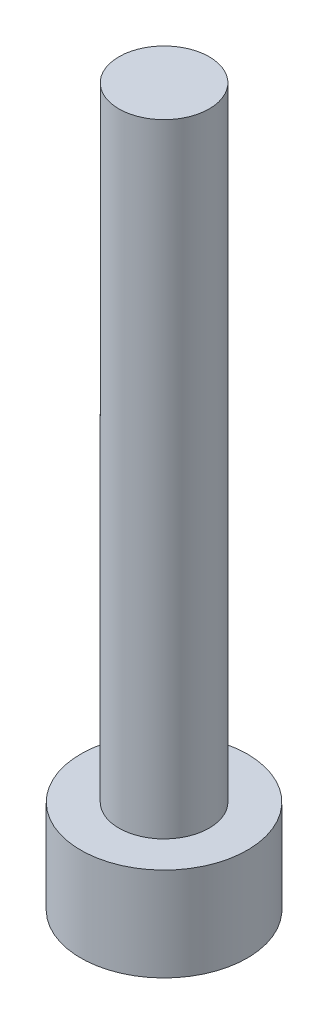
ISO-10303-21;
HEADER;
FILE_DESCRIPTION(('STEP AP214'),'2;1');
FILE_NAME('part.step','',(''),(''),'','','');
FILE_SCHEMA(('AUTOMOTIVE_DESIGN { 1 0 10303 214 1 1 1 1 }'));
ENDSEC;
DATA;
#1=APPLICATION_CONTEXT('core data for automotive mechanical design processes');
#2=APPLICATION_PROTOCOL_DEFINITION('international standard','automotive_design',2000,#1);
#3=PRODUCT_CONTEXT('',#1,'mechanical');
#4=PRODUCT('Part','Part','',(#3));
#5=PRODUCT_RELATED_PRODUCT_CATEGORY('part','',(#4));
#6=PRODUCT_DEFINITION_FORMATION('','',#4);
#7=PRODUCT_DEFINITION_CONTEXT('part definition',#1,'design');
#8=PRODUCT_DEFINITION('design','',#6,#7);
#9=PRODUCT_DEFINITION_SHAPE('','',#8);
#10=(LENGTH_UNIT() NAMED_UNIT(*) SI_UNIT(.MILLI.,.METRE.));
#11=(NAMED_UNIT(*) PLANE_ANGLE_UNIT() SI_UNIT($,.RADIAN.));
#12=(NAMED_UNIT(*) SI_UNIT($,.STERADIAN.) SOLID_ANGLE_UNIT());
#13=UNCERTAINTY_MEASURE_WITH_UNIT(LENGTH_MEASURE(1.E-05),#10,'distance_accuracy_value','');
#14=(GEOMETRIC_REPRESENTATION_CONTEXT(3) GLOBAL_UNCERTAINTY_ASSIGNED_CONTEXT((#13)) GLOBAL_UNIT_ASSIGNED_CONTEXT((#10,
#11,#12)) REPRESENTATION_CONTEXT('',''));
#15=CARTESIAN_POINT('',(0.,0.,0.));
#16=DIRECTION('',(0.,0.,1.));
#17=DIRECTION('',(1.,0.,0.));
#18=AXIS2_PLACEMENT_3D('',#15,#16,#17);
#19=CARTESIAN_POINT('',(0.,20.,0.));
#20=DIRECTION('',(0.,-1.,0.));
#21=DIRECTION('',(0.,0.,-1.));
#22=AXIS2_PLACEMENT_3D('',#19,#20,#21);
#23=CYLINDRICAL_SURFACE('',#22,1.45);
#24=CARTESIAN_POINT('',(0.,20.,0.));
#25=DIRECTION('',(0.,1.,0.));
#26=DIRECTION('',(0.,0.,1.));
#27=AXIS2_PLACEMENT_3D('',#24,#25,#26);
#28=CIRCLE('',#27,1.45);
#29=CARTESIAN_POINT('',(0.,20.,1.45));
#30=VERTEX_POINT('',#29);
#31=EDGE_CURVE('E11',#30,#30,#28,.T.);
#32=ORIENTED_EDGE('',*,*,#31,.F.);
#33=EDGE_LOOP('',(#32));
#34=FACE_BOUND('',#33,.T.);
#35=CARTESIAN_POINT('',(0.,0.,0.));
#36=DIRECTION('',(0.,-1.,0.));
#37=DIRECTION('',(0.,0.,-1.));
#38=AXIS2_PLACEMENT_3D('',#35,#36,#37);
#39=CIRCLE('',#38,1.45);
#40=CARTESIAN_POINT('',(0.,0.,-1.45));
#41=VERTEX_POINT('',#40);
#42=EDGE_CURVE('E39',#41,#41,#39,.T.);
#43=ORIENTED_EDGE('',*,*,#42,.F.);
#44=EDGE_LOOP('',(#43));
#45=FACE_BOUND('',#44,.T.);
#46=ADVANCED_FACE('F32',(#34,#45),#23,.T.);
#47=CARTESIAN_POINT('',(0.,20.,0.));
#48=DIRECTION('',(0.,1.,0.));
#49=DIRECTION('',(0.,0.,1.));
#50=AXIS2_PLACEMENT_3D('',#47,#48,#49);
#51=PLANE('',#50);
#52=ORIENTED_EDGE('',*,*,#31,.T.);
#53=EDGE_LOOP('',(#52));
#54=FACE_BOUND('',#53,.T.);
#55=ADVANCED_FACE('F149',(#54),#51,.T.);
#56=CARTESIAN_POINT('',(0.,0.,0.));
#57=DIRECTION('',(0.,-1.,0.));
#58=DIRECTION('',(0.,0.,-1.));
#59=AXIS2_PLACEMENT_3D('',#56,#57,#58);
#60=PLANE('',#59);
#61=CARTESIAN_POINT('',(0.,0.,0.));
#62=DIRECTION('',(0.,-1.,0.));
#63=DIRECTION('',(0.,0.,-1.));
#64=AXIS2_PLACEMENT_3D('',#61,#62,#63);
#65=CIRCLE('',#64,2.675);
#66=CARTESIAN_POINT('',(0.,0.,-2.675));
#67=VERTEX_POINT('',#66);
#68=EDGE_CURVE('E133',#67,#67,#65,.T.);
#69=ORIENTED_EDGE('',*,*,#68,.F.);
#70=EDGE_LOOP('',(#69));
#71=FACE_BOUND('',#70,.T.);
#72=ORIENTED_EDGE('',*,*,#42,.T.);
#73=EDGE_LOOP('',(#72));
#74=FACE_BOUND('',#73,.T.);
#75=ADVANCED_FACE('F146',(#71,#74),#60,.F.);
#76=CARTESIAN_POINT('',(0.,-3.,0.));
#77=DIRECTION('',(0.,1.,0.));
#78=DIRECTION('',(0.,0.,1.));
#79=AXIS2_PLACEMENT_3D('',#76,#77,#78);
#80=CYLINDRICAL_SURFACE('',#79,2.675);
#81=CARTESIAN_POINT('',(0.,-3.,0.));
#82=DIRECTION('',(0.,-1.,0.));
#83=DIRECTION('',(0.,0.,-1.));
#84=AXIS2_PLACEMENT_3D('',#81,#82,#83);
#85=CIRCLE('',#84,2.675);
#86=CARTESIAN_POINT('',(0.,-3.,-2.675));
#87=VERTEX_POINT('',#86);
#88=EDGE_CURVE('E139',#87,#87,#85,.T.);
#89=ORIENTED_EDGE('',*,*,#88,.F.);
#90=EDGE_LOOP('',(#89));
#91=FACE_BOUND('',#90,.T.);
#92=ORIENTED_EDGE('',*,*,#68,.T.);
#93=EDGE_LOOP('',(#92));
#94=FACE_BOUND('',#93,.T.);
#95=ADVANCED_FACE('F159',(#91,#94),#80,.T.);
#96=CARTESIAN_POINT('',(0.,-3.,0.));
#97=DIRECTION('',(0.,-1.,0.));
#98=DIRECTION('',(0.,0.,-1.));
#99=AXIS2_PLACEMENT_3D('',#96,#97,#98);
#100=PLANE('',#99);
#101=DIRECTION('',(0.23586840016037,0.,0.971785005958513));
#102=VECTOR('',#101,1.);
#103=CARTESIAN_POINT('',(1.25340948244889,-3.,-1.19539310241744));
#104=LINE('',#103,#102);
#105=CARTESIAN_POINT('',(1.25340948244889,-3.,-1.19539310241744));
#106=VERTEX_POINT('',#105);
#107=CARTESIAN_POINT('',(1.66194553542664,-3.,0.487787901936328));
#108=VERTEX_POINT('',#107);
#109=EDGE_CURVE('E46',#106,#108,#104,.T.);
#110=ORIENTED_EDGE('',*,*,#109,.F.);
#111=DIRECTION('',(0.95952470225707,0.,0.281624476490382));
#112=VECTOR('',#111,1.);
#113=CARTESIAN_POINT('',(-0.408536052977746,-3.,-1.68318100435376));
#114=LINE('',#113,#112);
#115=CARTESIAN_POINT('',(-0.408536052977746,-3.,-1.68318100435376));
#116=VERTEX_POINT('',#115);
#117=EDGE_CURVE('E129',#116,#106,#114,.T.);
#118=ORIENTED_EDGE('',*,*,#117,.F.);
#119=DIRECTION('',(0.723656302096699,0.,-0.690160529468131));
#120=VECTOR('',#119,1.);
#121=CARTESIAN_POINT('',(-1.66194553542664,-3.,-0.487787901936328));
#122=LINE('',#121,#120);
#123=CARTESIAN_POINT('',(-1.66194553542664,-3.,-0.487787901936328));
#124=VERTEX_POINT('',#123);
#125=EDGE_CURVE('E127',#124,#116,#122,.T.);
#126=ORIENTED_EDGE('',*,*,#125,.F.);
#127=DIRECTION('',(-0.23586840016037,0.,-0.971785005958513));
#128=VECTOR('',#127,1.);
#129=CARTESIAN_POINT('',(-1.25340948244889,-3.,1.19539310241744));
#130=LINE('',#129,#128);
#131=CARTESIAN_POINT('',(-1.25340948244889,-3.,1.19539310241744));
#132=VERTEX_POINT('',#131);
#133=EDGE_CURVE('E94',#132,#124,#130,.T.);
#134=ORIENTED_EDGE('',*,*,#133,.F.);
#135=DIRECTION('',(-0.95952470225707,0.,-0.281624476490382));
#136=VECTOR('',#135,1.);
#137=CARTESIAN_POINT('',(0.408536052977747,-3.,1.68318100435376));
#138=LINE('',#137,#136);
#139=CARTESIAN_POINT('',(0.408536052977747,-3.,1.68318100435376));
#140=VERTEX_POINT('',#139);
#141=EDGE_CURVE('E123',#140,#132,#138,.T.);
#142=ORIENTED_EDGE('',*,*,#141,.F.);
#143=DIRECTION('',(-0.723656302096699,0.,0.690160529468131));
#144=VECTOR('',#143,1.);
#145=CARTESIAN_POINT('',(1.66194553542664,-3.,0.487787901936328));
#146=LINE('',#145,#144);
#147=EDGE_CURVE('E120',#108,#140,#146,.T.);
#148=ORIENTED_EDGE('',*,*,#147,.F.);
#149=EDGE_LOOP('',(#110,#118,#126,#134,#142,#148));
#150=FACE_BOUND('',#149,.T.);
#151=ORIENTED_EDGE('',*,*,#88,.T.);
#152=EDGE_LOOP('',(#151));
#153=FACE_BOUND('',#152,.T.);
#154=ADVANCED_FACE('F164',(#150,#153),#100,.T.);
#155=CARTESIAN_POINT('',(1.25340948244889,-1.,-1.19539310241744));
#156=DIRECTION('',(0.971785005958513,0.,-0.23586840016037));
#157=DIRECTION('',(-0.23586840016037,0.,-0.971785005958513));
#158=AXIS2_PLACEMENT_3D('',#155,#156,#157);
#159=PLANE('',#158);
#160=ORIENTED_EDGE('',*,*,#109,.T.);
#161=DIRECTION('',(0.,-1.,0.));
#162=VECTOR('',#161,1.);
#163=CARTESIAN_POINT('',(1.66194553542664,-1.,0.487787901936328));
#164=LINE('',#163,#162);
#165=CARTESIAN_POINT('',(1.66194553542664,-1.,0.487787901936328));
#166=VERTEX_POINT('',#165);
#167=EDGE_CURVE('E76',#166,#108,#164,.T.);
#168=ORIENTED_EDGE('',*,*,#167,.F.);
#169=DIRECTION('',(0.23586840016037,0.,0.971785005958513));
#170=VECTOR('',#169,1.);
#171=CARTESIAN_POINT('',(1.25340948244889,-1.,-1.19539310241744));
#172=LINE('',#171,#170);
#173=CARTESIAN_POINT('',(1.25340948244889,-1.,-1.19539310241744));
#174=VERTEX_POINT('',#173);
#175=EDGE_CURVE('E131',#174,#166,#172,.T.);
#176=ORIENTED_EDGE('',*,*,#175,.F.);
#177=DIRECTION('',(0.,-1.,0.));
#178=VECTOR('',#177,1.);
#179=CARTESIAN_POINT('',(1.25340948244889,-1.,-1.19539310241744));
#180=LINE('',#179,#178);
#181=EDGE_CURVE('E54',#174,#106,#180,.T.);
#182=ORIENTED_EDGE('',*,*,#181,.T.);
#183=EDGE_LOOP('',(#160,#168,#176,#182));
#184=FACE_BOUND('',#183,.T.);
#185=ADVANCED_FACE('F169',(#184),#159,.F.);
#186=CARTESIAN_POINT('',(-0.408536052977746,-1.,-1.68318100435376));
#187=DIRECTION('',(0.281624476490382,0.,-0.95952470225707));
#188=DIRECTION('',(-0.95952470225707,0.,-0.281624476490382));
#189=AXIS2_PLACEMENT_3D('',#186,#187,#188);
#190=PLANE('',#189);
#191=ORIENTED_EDGE('',*,*,#117,.T.);
#192=ORIENTED_EDGE('',*,*,#181,.F.);
#193=DIRECTION('',(0.95952470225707,0.,0.281624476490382));
#194=VECTOR('',#193,1.);
#195=CARTESIAN_POINT('',(-0.408536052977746,-1.,-1.68318100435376));
#196=LINE('',#195,#194);
#197=CARTESIAN_POINT('',(-0.408536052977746,-1.,-1.68318100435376));
#198=VERTEX_POINT('',#197);
#199=EDGE_CURVE('E106',#198,#174,#196,.T.);
#200=ORIENTED_EDGE('',*,*,#199,.F.);
#201=DIRECTION('',(0.,-1.,0.));
#202=VECTOR('',#201,1.);
#203=CARTESIAN_POINT('',(-0.408536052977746,-1.,-1.68318100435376));
#204=LINE('',#203,#202);
#205=EDGE_CURVE('E98',#198,#116,#204,.T.);
#206=ORIENTED_EDGE('',*,*,#205,.T.);
#207=EDGE_LOOP('',(#191,#192,#200,#206));
#208=FACE_BOUND('',#207,.T.);
#209=ADVANCED_FACE('F173',(#208),#190,.F.);
#210=CARTESIAN_POINT('',(-1.66194553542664,-1.,-0.487787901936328));
#211=DIRECTION('',(-0.690160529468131,0.,-0.723656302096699));
#212=DIRECTION('',(-0.723656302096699,0.,0.690160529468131));
#213=AXIS2_PLACEMENT_3D('',#210,#211,#212);
#214=PLANE('',#213);
#215=ORIENTED_EDGE('',*,*,#125,.T.);
#216=ORIENTED_EDGE('',*,*,#205,.F.);
#217=DIRECTION('',(0.723656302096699,0.,-0.690160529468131));
#218=VECTOR('',#217,1.);
#219=CARTESIAN_POINT('',(-1.66194553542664,-1.,-0.487787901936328));
#220=LINE('',#219,#218);
#221=CARTESIAN_POINT('',(-1.66194553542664,-1.,-0.487787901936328));
#222=VERTEX_POINT('',#221);
#223=EDGE_CURVE('E102',#222,#198,#220,.T.);
#224=ORIENTED_EDGE('',*,*,#223,.F.);
#225=DIRECTION('',(0.,-1.,0.));
#226=VECTOR('',#225,1.);
#227=CARTESIAN_POINT('',(-1.66194553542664,-1.,-0.487787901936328));
#228=LINE('',#227,#226);
#229=EDGE_CURVE('E87',#222,#124,#228,.T.);
#230=ORIENTED_EDGE('',*,*,#229,.T.);
#231=EDGE_LOOP('',(#215,#216,#224,#230));
#232=FACE_BOUND('',#231,.T.);
#233=ADVANCED_FACE('F103',(#232),#214,.F.);
#234=CARTESIAN_POINT('',(-1.25340948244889,-1.,1.19539310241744));
#235=DIRECTION('',(-0.971785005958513,0.,0.23586840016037));
#236=DIRECTION('',(0.23586840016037,0.,0.971785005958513));
#237=AXIS2_PLACEMENT_3D('',#234,#235,#236);
#238=PLANE('',#237);
#239=ORIENTED_EDGE('',*,*,#133,.T.);
#240=ORIENTED_EDGE('',*,*,#229,.F.);
#241=DIRECTION('',(-0.23586840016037,0.,-0.971785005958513));
#242=VECTOR('',#241,1.);
#243=CARTESIAN_POINT('',(-1.25340948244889,-1.,1.19539310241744));
#244=LINE('',#243,#242);
#245=CARTESIAN_POINT('',(-1.25340948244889,-1.,1.19539310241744));
#246=VERTEX_POINT('',#245);
#247=EDGE_CURVE('E91',#246,#222,#244,.T.);
#248=ORIENTED_EDGE('',*,*,#247,.F.);
#249=DIRECTION('',(0.,-1.,0.));
#250=VECTOR('',#249,1.);
#251=CARTESIAN_POINT('',(-1.25340948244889,-1.,1.19539310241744));
#252=LINE('',#251,#250);
#253=EDGE_CURVE('E99',#246,#132,#252,.T.);
#254=ORIENTED_EDGE('',*,*,#253,.T.);
#255=EDGE_LOOP('',(#239,#240,#248,#254));
#256=FACE_BOUND('',#255,.T.);
#257=ADVANCED_FACE('F89',(#256),#238,.F.);
#258=CARTESIAN_POINT('',(0.408536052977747,-1.,1.68318100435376));
#259=DIRECTION('',(-0.281624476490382,0.,0.95952470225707));
#260=DIRECTION('',(0.95952470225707,0.,0.281624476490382));
#261=AXIS2_PLACEMENT_3D('',#258,#259,#260);
#262=PLANE('',#261);
#263=ORIENTED_EDGE('',*,*,#141,.T.);
#264=ORIENTED_EDGE('',*,*,#253,.F.);
#265=DIRECTION('',(-0.95952470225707,0.,-0.281624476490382));
#266=VECTOR('',#265,1.);
#267=CARTESIAN_POINT('',(0.408536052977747,-1.,1.68318100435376));
#268=LINE('',#267,#266);
#269=CARTESIAN_POINT('',(0.408536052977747,-1.,1.68318100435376));
#270=VERTEX_POINT('',#269);
#271=EDGE_CURVE('E112',#270,#246,#268,.T.);
#272=ORIENTED_EDGE('',*,*,#271,.F.);
#273=DIRECTION('',(0.,-1.,0.));
#274=VECTOR('',#273,1.);
#275=CARTESIAN_POINT('',(0.408536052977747,-1.,1.68318100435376));
#276=LINE('',#275,#274);
#277=EDGE_CURVE('E136',#270,#140,#276,.T.);
#278=ORIENTED_EDGE('',*,*,#277,.T.);
#279=EDGE_LOOP('',(#263,#264,#272,#278));
#280=FACE_BOUND('',#279,.T.);
#281=ADVANCED_FACE('F177',(#280),#262,.F.);
#282=CARTESIAN_POINT('',(1.66194553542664,-1.,0.487787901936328));
#283=DIRECTION('',(0.690160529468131,0.,0.723656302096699));
#284=DIRECTION('',(0.723656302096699,0.,-0.690160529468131));
#285=AXIS2_PLACEMENT_3D('',#282,#283,#284);
#286=PLANE('',#285);
#287=ORIENTED_EDGE('',*,*,#147,.T.);
#288=ORIENTED_EDGE('',*,*,#277,.F.);
#289=DIRECTION('',(-0.723656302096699,0.,0.690160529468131));
#290=VECTOR('',#289,1.);
#291=CARTESIAN_POINT('',(1.66194553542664,-1.,0.487787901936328));
#292=LINE('',#291,#290);
#293=EDGE_CURVE('E114',#166,#270,#292,.T.);
#294=ORIENTED_EDGE('',*,*,#293,.F.);
#295=ORIENTED_EDGE('',*,*,#167,.T.);
#296=EDGE_LOOP('',(#287,#288,#294,#295));
#297=FACE_BOUND('',#296,.T.);
#298=ADVANCED_FACE('F174',(#297),#286,.F.);
#299=CARTESIAN_POINT('',(0.,-1.,0.));
#300=DIRECTION('',(0.,-1.,0.));
#301=DIRECTION('',(0.,0.,-1.));
#302=AXIS2_PLACEMENT_3D('',#299,#300,#301);
#303=PLANE('',#302);
#304=ORIENTED_EDGE('',*,*,#175,.T.);
#305=ORIENTED_EDGE('',*,*,#293,.T.);
#306=ORIENTED_EDGE('',*,*,#271,.T.);
#307=ORIENTED_EDGE('',*,*,#247,.T.);
#308=ORIENTED_EDGE('',*,*,#223,.T.);
#309=ORIENTED_EDGE('',*,*,#199,.T.);
#310=EDGE_LOOP('',(#304,#305,#306,#307,#308,#309));
#311=FACE_BOUND('',#310,.T.);
#312=ADVANCED_FACE('F109',(#311),#303,.T.);
#313=CLOSED_SHELL('',(#46,#55,#75,#95,#154,#185,#209,#233,#257,#281,#298,#312));
#314=MANIFOLD_SOLID_BREP('B2',#313);
#315=ADVANCED_BREP_SHAPE_REPRESENTATION('',(#18,#314),#14);
#316=SHAPE_DEFINITION_REPRESENTATION(#9,#315);
ENDSEC;
END-ISO-10303-21;
